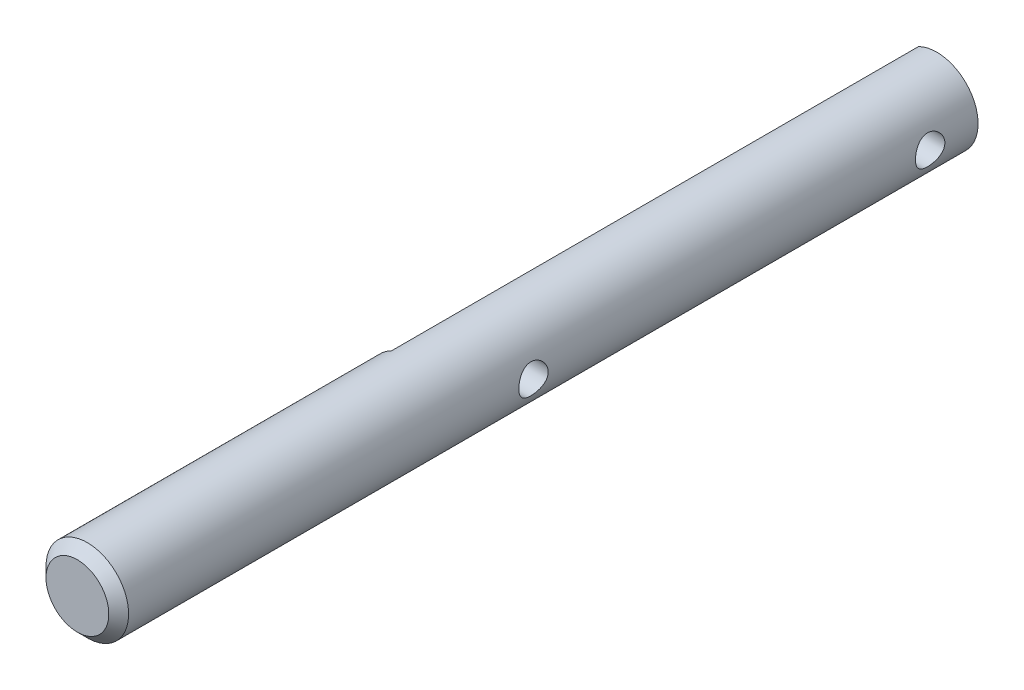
ISO-10303-21;
HEADER;
FILE_DESCRIPTION(('STEP AP214'),'2;1');
FILE_NAME('part.step','',(''),(''),'','','');
FILE_SCHEMA(('AUTOMOTIVE_DESIGN { 1 0 10303 214 1 1 1 1 }'));
ENDSEC;
DATA;
#1=APPLICATION_CONTEXT('core data for automotive mechanical design processes');
#2=APPLICATION_PROTOCOL_DEFINITION('international standard','automotive_design',2000,#1);
#3=PRODUCT_CONTEXT('',#1,'mechanical');
#4=PRODUCT('Part','Part','',(#3));
#5=PRODUCT_RELATED_PRODUCT_CATEGORY('part','',(#4));
#6=PRODUCT_DEFINITION_FORMATION('','',#4);
#7=PRODUCT_DEFINITION_CONTEXT('part definition',#1,'design');
#8=PRODUCT_DEFINITION('design','',#6,#7);
#9=PRODUCT_DEFINITION_SHAPE('','',#8);
#10=(LENGTH_UNIT() NAMED_UNIT(*) SI_UNIT(.MILLI.,.METRE.));
#11=(NAMED_UNIT(*) PLANE_ANGLE_UNIT() SI_UNIT($,.RADIAN.));
#12=(NAMED_UNIT(*) SI_UNIT($,.STERADIAN.) SOLID_ANGLE_UNIT());
#13=UNCERTAINTY_MEASURE_WITH_UNIT(LENGTH_MEASURE(1.E-05),#10,'distance_accuracy_value','');
#14=(GEOMETRIC_REPRESENTATION_CONTEXT(3) GLOBAL_UNCERTAINTY_ASSIGNED_CONTEXT((#13)) GLOBAL_UNIT_ASSIGNED_CONTEXT((#10,
#11,#12)) REPRESENTATION_CONTEXT('',''));
#15=CARTESIAN_POINT('',(0.,0.,0.));
#16=DIRECTION('',(0.,0.,1.));
#17=DIRECTION('',(1.,0.,0.));
#18=AXIS2_PLACEMENT_3D('',#15,#16,#17);
#19=CARTESIAN_POINT('',(0.,0.,160.02));
#20=DIRECTION('',(0.,0.,-1.));
#21=DIRECTION('',(-1.,0.,0.));
#22=AXIS2_PLACEMENT_3D('',#19,#20,#21);
#23=CYLINDRICAL_SURFACE('',#22,3.175);
#24=CARTESIAN_POINT('',(3.175,0.,127.0127));
#25=CARTESIAN_POINT('',(3.17500087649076,-0.0614285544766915,127.012698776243));
#26=CARTESIAN_POINT('',(3.17320130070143,-0.1228483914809,127.017723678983));
#27=CARTESIAN_POINT('',(3.1662010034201,-0.243864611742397,127.037618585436));
#28=CARTESIAN_POINT('',(3.16100038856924,-0.3034610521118,127.05248828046));
#29=CARTESIAN_POINT('',(3.14775949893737,-0.419068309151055,127.091488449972));
#30=CARTESIAN_POINT('',(3.13972436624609,-0.475085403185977,127.115602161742));
#31=CARTESIAN_POINT('',(3.12162393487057,-0.582278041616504,127.172325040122));
#32=CARTESIAN_POINT('',(3.11155815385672,-0.633452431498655,127.204936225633));
#33=CARTESIAN_POINT('',(3.09000790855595,-0.731495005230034,127.279055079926));
#34=CARTESIAN_POINT('',(3.07848610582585,-0.778149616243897,127.320834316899));
#35=CARTESIAN_POINT('',(3.055516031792,-0.863958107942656,127.411526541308));
#36=CARTESIAN_POINT('',(3.04406778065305,-0.903110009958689,127.460441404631));
#37=CARTESIAN_POINT('',(3.02211785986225,-0.974093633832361,127.566025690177));
#38=CARTESIAN_POINT('',(3.01166094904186,-1.00563502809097,127.622900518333));
#39=CARTESIAN_POINT('',(2.99345244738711,-1.0586113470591,127.7415793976));
#40=CARTESIAN_POINT('',(2.98569989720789,-1.08004985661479,127.803381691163));
#41=CARTESIAN_POINT('',(2.9741742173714,-1.11138819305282,127.927714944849));
#42=CARTESIAN_POINT('',(2.97026214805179,-1.12169236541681,127.990130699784));
#43=CARTESIAN_POINT('',(2.96645158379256,-1.13173392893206,128.115918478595));
#44=CARTESIAN_POINT('',(2.96655163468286,-1.13147514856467,128.179290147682));
#45=CARTESIAN_POINT('',(2.97063328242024,-1.12070953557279,128.301613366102));
#46=CARTESIAN_POINT('',(2.97440855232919,-1.11074743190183,128.360620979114));
#47=CARTESIAN_POINT('',(2.98507483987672,-1.08175290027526,128.476064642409));
#48=CARTESIAN_POINT('',(2.99196628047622,-1.06271924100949,128.53250034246));
#49=CARTESIAN_POINT('',(3.00822311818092,-1.01579639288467,128.642367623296));
#50=CARTESIAN_POINT('',(3.01763009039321,-0.9877566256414,128.695728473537));
#51=CARTESIAN_POINT('',(3.03784253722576,-0.923722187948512,128.797152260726));
#52=CARTESIAN_POINT('',(3.04864845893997,-0.887724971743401,128.845213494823));
#53=CARTESIAN_POINT('',(3.07123422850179,-0.806247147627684,128.937711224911));
#54=CARTESIAN_POINT('',(3.08303358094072,-0.760326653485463,128.981756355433));
#55=CARTESIAN_POINT('',(3.1057139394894,-0.661610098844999,129.061630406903));
#56=CARTESIAN_POINT('',(3.11659483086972,-0.608813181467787,129.097458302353));
#57=CARTESIAN_POINT('',(3.13639217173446,-0.496923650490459,129.160256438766));
#58=CARTESIAN_POINT('',(3.14528190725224,-0.437759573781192,129.187108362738));
#59=CARTESIAN_POINT('',(3.15989936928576,-0.315359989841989,129.23035200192));
#60=CARTESIAN_POINT('',(3.16562835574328,-0.252126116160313,129.246747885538));
#61=CARTESIAN_POINT('',(3.17306329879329,-0.126684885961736,129.26788948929));
#62=CARTESIAN_POINT('',(3.17495136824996,-0.0645771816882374,129.273163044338));
#63=CARTESIAN_POINT('',(3.17504672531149,0.059656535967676,129.273431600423));
#64=CARTESIAN_POINT('',(3.1732547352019,0.121782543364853,129.268428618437));
#65=CARTESIAN_POINT('',(3.16631168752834,0.242087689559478,129.248695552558));
#66=CARTESIAN_POINT('',(3.16127656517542,0.300329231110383,129.234300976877));
#67=CARTESIAN_POINT('',(3.14846933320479,0.413538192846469,129.19662458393));
#68=CARTESIAN_POINT('',(3.14069686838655,0.468505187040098,129.173341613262));
#69=CARTESIAN_POINT('',(3.12292068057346,0.575332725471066,129.117831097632));
#70=CARTESIAN_POINT('',(3.11286035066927,0.627062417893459,129.085370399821));
#71=CARTESIAN_POINT('',(3.09163517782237,0.724505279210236,129.012693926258));
#72=CARTESIAN_POINT('',(3.08046995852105,0.770216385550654,128.972475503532));
#73=CARTESIAN_POINT('',(3.05754963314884,0.856811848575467,128.882951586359));
#74=CARTESIAN_POINT('',(3.04579412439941,0.897320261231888,128.833281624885));
#75=CARTESIAN_POINT('',(3.02359841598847,0.969488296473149,128.727605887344));
#76=CARTESIAN_POINT('',(3.01315827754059,1.00114750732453,128.671599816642));
#77=CARTESIAN_POINT('',(2.99485112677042,1.05465477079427,128.554607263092));
#78=CARTESIAN_POINT('',(2.98698641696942,1.07649405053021,128.493616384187));
#79=CARTESIAN_POINT('',(2.97489781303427,1.10946944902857,128.36847036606));
#80=CARTESIAN_POINT('',(2.97067196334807,1.12061131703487,128.304316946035));
#81=CARTESIAN_POINT('',(2.96658222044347,1.13139068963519,128.178694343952));
#82=CARTESIAN_POINT('',(2.9664783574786,1.13166111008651,128.117286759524));
#83=CARTESIAN_POINT('',(2.97003931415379,1.1222816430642,127.995351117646));
#84=CARTESIAN_POINT('',(2.97370384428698,1.11263251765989,127.934822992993));
#85=CARTESIAN_POINT('',(2.98419839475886,1.08416089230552,127.817872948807));
#86=CARTESIAN_POINT('',(2.9909477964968,1.06557142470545,127.761386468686));
#87=CARTESIAN_POINT('',(3.00681233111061,1.01994372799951,127.652295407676));
#88=CARTESIAN_POINT('',(3.01592803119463,0.992903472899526,127.599691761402));
#89=CARTESIAN_POINT('',(3.03604854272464,0.929616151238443,127.497090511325));
#90=CARTESIAN_POINT('',(3.04712352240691,0.892986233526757,127.447342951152));
#91=CARTESIAN_POINT('',(3.06964995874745,0.812177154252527,127.354497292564));
#92=CARTESIAN_POINT('',(3.08110152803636,0.767995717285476,127.311401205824));
#93=CARTESIAN_POINT('',(3.10373428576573,0.670861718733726,127.231036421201));
#94=CARTESIAN_POINT('',(3.11487776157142,0.617595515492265,127.194134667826));
#95=CARTESIAN_POINT('',(3.13506244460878,0.505234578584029,127.129834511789));
#96=CARTESIAN_POINT('',(3.1441038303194,0.446140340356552,127.102435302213));
#97=CARTESIAN_POINT('',(3.15906443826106,0.323645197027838,127.058066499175));
#98=CARTESIAN_POINT('',(3.16497811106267,0.260236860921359,127.041115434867));
#99=CARTESIAN_POINT('',(3.17294468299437,0.131215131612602,127.018434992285));
#100=CARTESIAN_POINT('',(3.17499906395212,0.0656025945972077,127.012701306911));
#101=CARTESIAN_POINT('',(3.175,0.,127.0127));
#102=B_SPLINE_CURVE_WITH_KNOTS('',3,(#24,#25,#26,#27,#28,#29,#30,#31,#32,#33,#34,#35,#36,#37,
#38,#39,#40,#41,#42,#43,#44,#45,#46,#47,#48,#49,#50,#51,#52,#53,#54,#55,#56,#57,#58,#59,#60,#61,
#62,#63,#64,#65,#66,#67,#68,#69,#70,#71,#72,#73,#74,#75,#76,#77,#78,#79,#80,#81,#82,#83,#84,#85,
#86,#87,#88,#89,#90,#91,#92,#93,#94,#95,#96,#97,#98,#99,#100,#101),.UNSPECIFIED.,.T.,.F.,(4,2,2,
2,2,2,2,2,2,2,2,2,2,2,2,2,2,2,2,2,2,2,2,2,2,2,2,2,2,2,2,2,2,2,2,2,2,2,4),(0.,0.184043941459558,
0.368082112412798,0.551788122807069,0.735537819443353,0.925722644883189,1.11595755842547,
1.31258758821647,1.50914779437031,1.6983014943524,1.88738663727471,2.06643452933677,
2.24550673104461,2.42774410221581,2.61003985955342,2.80329006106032,2.99656436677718,
3.19229416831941,3.38794589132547,3.57408187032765,3.76018131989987,3.93997181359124,
4.11978564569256,4.30465683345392,4.48959121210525,4.6841682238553,4.87875428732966,
5.07351384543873,5.2681686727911,5.45147357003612,5.634764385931,5.81351722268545,
5.9923129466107,6.17977826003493,6.36730015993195,6.56359488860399,6.75987294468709,
6.95649809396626,7.15304773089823),.UNSPECIFIED.);
#103=CARTESIAN_POINT('',(3.175,0.,127.0127));
#104=VERTEX_POINT('',#103);
#105=EDGE_CURVE('E84',#104,#104,#102,.T.);
#106=ORIENTED_EDGE('',*,*,#105,.T.);
#107=EDGE_LOOP('',(#106));
#108=FACE_BOUND('',#107,.T.);
#109=CARTESIAN_POINT('',(3.175,0.,96.5327));
#110=CARTESIAN_POINT('',(3.17500087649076,-0.0614285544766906,96.5326987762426));
#111=CARTESIAN_POINT('',(3.17320130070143,-0.122848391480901,96.5377236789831));
#112=CARTESIAN_POINT('',(3.1662010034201,-0.243864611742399,96.5576185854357));
#113=CARTESIAN_POINT('',(3.16100038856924,-0.303461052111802,96.57248828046));
#114=CARTESIAN_POINT('',(3.14775949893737,-0.419068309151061,96.6114884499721));
#115=CARTESIAN_POINT('',(3.13972436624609,-0.475085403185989,96.6356021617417));
#116=CARTESIAN_POINT('',(3.12162393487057,-0.58227804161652,96.6923250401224));
#117=CARTESIAN_POINT('',(3.11155815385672,-0.633452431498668,96.7249362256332));
#118=CARTESIAN_POINT('',(3.09000790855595,-0.731495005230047,96.7990550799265));
#119=CARTESIAN_POINT('',(3.07848610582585,-0.778149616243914,96.8408343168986));
#120=CARTESIAN_POINT('',(3.05551603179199,-0.863958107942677,96.9315265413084));
#121=CARTESIAN_POINT('',(3.04406778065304,-0.903110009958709,96.9804414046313));
#122=CARTESIAN_POINT('',(3.02211785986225,-0.974093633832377,97.086025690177));
#123=CARTESIAN_POINT('',(3.01166094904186,-1.00563502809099,97.1429005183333));
#124=CARTESIAN_POINT('',(2.9934524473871,-1.05861134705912,97.2615793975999));
#125=CARTESIAN_POINT('',(2.98569989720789,-1.08004985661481,97.3233816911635));
#126=CARTESIAN_POINT('',(2.97417421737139,-1.11138819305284,97.4477149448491));
#127=CARTESIAN_POINT('',(2.97026214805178,-1.12169236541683,97.5101306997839));
#128=CARTESIAN_POINT('',(2.96645158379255,-1.13173392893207,97.6359184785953));
#129=CARTESIAN_POINT('',(2.96655163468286,-1.13147514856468,97.6992901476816));
#130=CARTESIAN_POINT('',(2.97063328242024,-1.1207095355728,97.8216133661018));
#131=CARTESIAN_POINT('',(2.97440855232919,-1.11074743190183,97.8806209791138));
#132=CARTESIAN_POINT('',(2.98507483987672,-1.08175290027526,97.9960646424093));
#133=CARTESIAN_POINT('',(2.99196628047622,-1.06271924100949,98.0525003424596));
#134=CARTESIAN_POINT('',(3.00822311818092,-1.01579639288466,98.162367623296));
#135=CARTESIAN_POINT('',(3.01763009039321,-0.987756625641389,98.2157284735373));
#136=CARTESIAN_POINT('',(3.03784253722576,-0.9237221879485,98.317152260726));
#137=CARTESIAN_POINT('',(3.04864845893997,-0.887724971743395,98.3652134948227));
#138=CARTESIAN_POINT('',(3.07123422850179,-0.806247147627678,98.4577112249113));
#139=CARTESIAN_POINT('',(3.08303358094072,-0.760326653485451,98.5017563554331));
#140=CARTESIAN_POINT('',(3.10571393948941,-0.661610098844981,98.581630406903));
#141=CARTESIAN_POINT('',(3.11659483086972,-0.608813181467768,98.617458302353));
#142=CARTESIAN_POINT('',(3.13639217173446,-0.49692365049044,98.6802564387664));
#143=CARTESIAN_POINT('',(3.14528190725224,-0.437759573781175,98.7071083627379));
#144=CARTESIAN_POINT('',(3.15989936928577,-0.315359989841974,98.7503520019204));
#145=CARTESIAN_POINT('',(3.16562835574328,-0.252126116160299,98.7667478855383));
#146=CARTESIAN_POINT('',(3.17306329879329,-0.126684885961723,98.7878894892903));
#147=CARTESIAN_POINT('',(3.17495136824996,-0.0645771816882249,98.7931630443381));
#148=CARTESIAN_POINT('',(3.17504672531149,0.0596565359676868,98.7934316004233));
#149=CARTESIAN_POINT('',(3.1732547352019,0.121782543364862,98.7884286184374));
#150=CARTESIAN_POINT('',(3.16631168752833,0.242087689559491,98.7686955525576));
#151=CARTESIAN_POINT('',(3.16127656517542,0.300329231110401,98.7543009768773));
#152=CARTESIAN_POINT('',(3.14846933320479,0.41353819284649,98.71662458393));
#153=CARTESIAN_POINT('',(3.14069686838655,0.468505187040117,98.6933416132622));
#154=CARTESIAN_POINT('',(3.12292068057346,0.57533272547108,98.6378310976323));
#155=CARTESIAN_POINT('',(3.11286035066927,0.627062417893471,98.605370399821));
#156=CARTESIAN_POINT('',(3.09163517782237,0.724505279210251,98.5326939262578));
#157=CARTESIAN_POINT('',(3.08046995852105,0.770216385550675,98.4924755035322));
#158=CARTESIAN_POINT('',(3.05754963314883,0.85681184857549,98.402951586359));
#159=CARTESIAN_POINT('',(3.0457941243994,0.897320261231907,98.3532816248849));
#160=CARTESIAN_POINT('',(3.02359841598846,0.969488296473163,98.2476058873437));
#161=CARTESIAN_POINT('',(3.01315827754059,1.00114750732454,98.191599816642));
#162=CARTESIAN_POINT('',(2.99485112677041,1.05465477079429,98.0746072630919));
#163=CARTESIAN_POINT('',(2.98698641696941,1.07649405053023,98.0136163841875));
#164=CARTESIAN_POINT('',(2.97489781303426,1.10946944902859,97.8884703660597));
#165=CARTESIAN_POINT('',(2.97067196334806,1.12061131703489,97.8243169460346));
#166=CARTESIAN_POINT('',(2.96658222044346,1.1313906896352,97.6986943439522));
#167=CARTESIAN_POINT('',(2.9664783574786,1.13166111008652,97.6372867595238));
#168=CARTESIAN_POINT('',(2.97003931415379,1.12228164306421,97.5153511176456));
#169=CARTESIAN_POINT('',(2.97370384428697,1.1126325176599,97.4548229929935));
#170=CARTESIAN_POINT('',(2.98419839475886,1.08416089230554,97.3378729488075));
#171=CARTESIAN_POINT('',(2.9909477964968,1.06557142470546,97.2813864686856));
#172=CARTESIAN_POINT('',(3.0068123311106,1.01994372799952,97.172295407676));
#173=CARTESIAN_POINT('',(3.01592803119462,0.992903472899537,97.1196917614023));
#174=CARTESIAN_POINT('',(3.03604854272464,0.929616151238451,97.0170905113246));
#175=CARTESIAN_POINT('',(3.0471235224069,0.892986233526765,96.9673429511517));
#176=CARTESIAN_POINT('',(3.06964995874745,0.812177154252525,96.8744972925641));
#177=CARTESIAN_POINT('',(3.08110152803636,0.767995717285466,96.8314012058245));
#178=CARTESIAN_POINT('',(3.10373428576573,0.670861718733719,96.7510364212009));
#179=CARTESIAN_POINT('',(3.11487776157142,0.617595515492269,96.714134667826));
#180=CARTESIAN_POINT('',(3.13506244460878,0.505234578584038,96.6498345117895));
#181=CARTESIAN_POINT('',(3.1441038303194,0.446140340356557,96.6224353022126));
#182=CARTESIAN_POINT('',(3.15906443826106,0.323645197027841,96.5780664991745));
#183=CARTESIAN_POINT('',(3.16497811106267,0.260236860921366,96.5611154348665));
#184=CARTESIAN_POINT('',(3.17294468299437,0.13121513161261,96.5384349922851));
#185=CARTESIAN_POINT('',(3.17499906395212,0.0656025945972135,96.5327013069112));
#186=CARTESIAN_POINT('',(3.175,0.,96.5327));
#187=B_SPLINE_CURVE_WITH_KNOTS('',3,(#109,#110,#111,#112,#113,#114,#115,#116,#117,#118,#119,
#120,#121,#122,#123,#124,#125,#126,#127,#128,#129,#130,#131,#132,#133,#134,#135,#136,#137,#138,
#139,#140,#141,#142,#143,#144,#145,#146,#147,#148,#149,#150,#151,#152,#153,#154,#155,#156,#157,
#158,#159,#160,#161,#162,#163,#164,#165,#166,#167,#168,#169,#170,#171,#172,#173,#174,#175,#176,
#177,#178,#179,#180,#181,#182,#183,#184,#185,#186),.UNSPECIFIED.,.T.,.F.,(4,2,2,2,2,2,2,2,2,2,2,
2,2,2,2,2,2,2,2,2,2,2,2,2,2,2,2,2,2,2,2,2,2,2,2,2,2,2,4),(0.,0.184043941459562,
0.368082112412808,0.551788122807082,0.735537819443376,0.925722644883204,1.1159575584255,
1.31258758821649,1.50914779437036,1.69830149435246,1.88738663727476,2.06643452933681,
2.24550673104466,2.42774410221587,2.61003985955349,2.80329006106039,2.99656436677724,
3.19229416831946,3.38794589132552,3.5740818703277,3.76018131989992,3.9399718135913,
4.11978564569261,4.30465683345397,4.48959121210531,4.68416822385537,4.87875428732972,
5.07351384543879,5.26816867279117,5.45147357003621,5.63476438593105,5.81351722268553,
5.99231294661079,6.17977826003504,6.36730015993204,6.56359488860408,6.75987294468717,
6.95649809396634,7.15304773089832),.UNSPECIFIED.);
#188=CARTESIAN_POINT('',(3.175,0.,96.5327));
#189=VERTEX_POINT('',#188);
#190=EDGE_CURVE('E78',#189,#189,#187,.T.);
#191=ORIENTED_EDGE('',*,*,#190,.T.);
#192=EDGE_LOOP('',(#191));
#193=FACE_BOUND('',#192,.T.);
#194=CARTESIAN_POINT('',(0.,0.,159.258));
#195=DIRECTION('',(0.,0.,1.));
#196=DIRECTION('',(1.,0.,0.));
#197=AXIS2_PLACEMENT_3D('',#194,#195,#196);
#198=CIRCLE('',#197,3.175);
#199=CARTESIAN_POINT('',(-3.17500000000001,0.,159.258));
#200=VERTEX_POINT('',#199);
#201=EDGE_CURVE('E67',#200,#200,#198,.F.);
#202=ORIENTED_EDGE('',*,*,#201,.T.);
#203=EDGE_LOOP('',(#202));
#204=FACE_BOUND('',#203,.T.);
#205=CARTESIAN_POINT('',(0.,0.,93.98));
#206=DIRECTION('',(0.,0.,-1.));
#207=DIRECTION('',(-1.,0.,0.));
#208=AXIS2_PLACEMENT_3D('',#205,#206,#207);
#209=CIRCLE('',#208,3.175);
#210=CARTESIAN_POINT('',(-1.397,2.85114292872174,93.98));
#211=VERTEX_POINT('',#210);
#212=CARTESIAN_POINT('',(-1.397,-2.85114292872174,93.98));
#213=VERTEX_POINT('',#212);
#214=EDGE_CURVE('E46',#211,#213,#209,.T.);
#215=ORIENTED_EDGE('',*,*,#214,.F.);
#216=DIRECTION('',(0.,0.,-1.));
#217=VECTOR('',#216,1.);
#218=CARTESIAN_POINT('',(-1.397,2.85114292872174,160.02));
#219=LINE('',#218,#217);
#220=CARTESIAN_POINT('',(-1.397,2.85114292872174,134.493));
#221=VERTEX_POINT('',#220);
#222=EDGE_CURVE('E63',#221,#211,#219,.T.);
#223=ORIENTED_EDGE('',*,*,#222,.F.);
#224=CARTESIAN_POINT('',(0.,0.,134.493));
#225=DIRECTION('',(0.,0.,-1.));
#226=DIRECTION('',(-1.,0.,0.));
#227=AXIS2_PLACEMENT_3D('',#224,#225,#226);
#228=CIRCLE('',#227,3.175);
#229=CARTESIAN_POINT('',(-1.397,-2.85114292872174,134.493));
#230=VERTEX_POINT('',#229);
#231=EDGE_CURVE('E40',#230,#221,#228,.T.);
#232=ORIENTED_EDGE('',*,*,#231,.F.);
#233=DIRECTION('',(0.,0.,-1.));
#234=VECTOR('',#233,1.);
#235=CARTESIAN_POINT('',(-1.397,-2.85114292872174,160.02));
#236=LINE('',#235,#234);
#237=EDGE_CURVE('E52',#213,#230,#236,.F.);
#238=ORIENTED_EDGE('',*,*,#237,.F.);
#239=EDGE_LOOP('',(#215,#223,#232,#238));
#240=FACE_BOUND('',#239,.T.);
#241=ADVANCED_FACE('F32',(#108,#193,#204,#240),#23,.T.);
#242=CARTESIAN_POINT('',(-1.397,-3.175,7.493));
#243=DIRECTION('',(-1.,0.,0.));
#244=DIRECTION('',(0.,0.,1.));
#245=AXIS2_PLACEMENT_3D('',#242,#243,#244);
#246=PLANE('',#245);
#247=CARTESIAN_POINT('',(-1.397,0.,128.143));
#248=DIRECTION('',(-1.,0.,0.));
#249=DIRECTION('',(0.,0.,1.));
#250=AXIS2_PLACEMENT_3D('',#247,#248,#249);
#251=CIRCLE('',#250,1.13029999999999);
#252=CARTESIAN_POINT('',(-1.397,0.,129.2733));
#253=VERTEX_POINT('',#252);
#254=EDGE_CURVE('E128',#253,#253,#251,.F.);
#255=ORIENTED_EDGE('',*,*,#254,.T.);
#256=EDGE_LOOP('',(#255));
#257=FACE_BOUND('',#256,.T.);
#258=CARTESIAN_POINT('',(-1.397,0.,97.663));
#259=DIRECTION('',(-1.,0.,0.));
#260=DIRECTION('',(0.,0.,1.));
#261=AXIS2_PLACEMENT_3D('',#258,#259,#260);
#262=CIRCLE('',#261,1.1303);
#263=CARTESIAN_POINT('',(-1.397,0.,98.7933));
#264=VERTEX_POINT('',#263);
#265=EDGE_CURVE('E72',#264,#264,#262,.F.);
#266=ORIENTED_EDGE('',*,*,#265,.T.);
#267=EDGE_LOOP('',(#266));
#268=FACE_BOUND('',#267,.T.);
#269=ORIENTED_EDGE('',*,*,#222,.T.);
#270=DIRECTION('',(0.,-1.,0.));
#271=VECTOR('',#270,1.);
#272=CARTESIAN_POINT('',(-1.397,-3.175,93.98));
#273=LINE('',#272,#271);
#274=EDGE_CURVE('E11',#211,#213,#273,.T.);
#275=ORIENTED_EDGE('',*,*,#274,.T.);
#276=ORIENTED_EDGE('',*,*,#237,.T.);
#277=DIRECTION('',(0.,-1.,0.));
#278=VECTOR('',#277,1.);
#279=CARTESIAN_POINT('',(-1.397,3.175,134.493));
#280=LINE('',#279,#278);
#281=EDGE_CURVE('E64',#221,#230,#280,.T.);
#282=ORIENTED_EDGE('',*,*,#281,.F.);
#283=EDGE_LOOP('',(#269,#275,#276,#282));
#284=FACE_BOUND('',#283,.T.);
#285=ADVANCED_FACE('F66',(#257,#268,#284),#246,.T.);
#286=CARTESIAN_POINT('',(-3.175,0.,97.663));
#287=DIRECTION('',(1.,0.,0.));
#288=DIRECTION('',(0.,0.,-1.));
#289=AXIS2_PLACEMENT_3D('',#286,#287,#288);
#290=CYLINDRICAL_SURFACE('',#289,1.1303);
#291=ORIENTED_EDGE('',*,*,#190,.F.);
#292=EDGE_LOOP('',(#291));
#293=FACE_BOUND('',#292,.T.);
#294=ORIENTED_EDGE('',*,*,#265,.F.);
#295=EDGE_LOOP('',(#294));
#296=FACE_BOUND('',#295,.T.);
#297=ADVANCED_FACE('F91',(#293,#296),#290,.F.);
#298=CARTESIAN_POINT('',(-3.175,0.,128.143));
#299=DIRECTION('',(1.,0.,0.));
#300=DIRECTION('',(0.,0.,-1.));
#301=AXIS2_PLACEMENT_3D('',#298,#299,#300);
#302=CYLINDRICAL_SURFACE('',#301,1.13029999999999);
#303=ORIENTED_EDGE('',*,*,#105,.F.);
#304=EDGE_LOOP('',(#303));
#305=FACE_BOUND('',#304,.T.);
#306=ORIENTED_EDGE('',*,*,#254,.F.);
#307=EDGE_LOOP('',(#306));
#308=FACE_BOUND('',#307,.T.);
#309=ADVANCED_FACE('F94',(#305,#308),#302,.F.);
#310=CARTESIAN_POINT('',(0.,0.,160.02));
#311=DIRECTION('',(0.,0.,1.));
#312=DIRECTION('',(1.,0.,0.));
#313=AXIS2_PLACEMENT_3D('',#310,#311,#312);
#314=PLANE('',#313);
#315=CARTESIAN_POINT('',(0.,0.,160.02));
#316=DIRECTION('',(0.,0.,1.));
#317=DIRECTION('',(1.,0.,0.));
#318=AXIS2_PLACEMENT_3D('',#315,#316,#317);
#319=CIRCLE('',#318,2.41299999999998);
#320=CARTESIAN_POINT('',(-2.413,0.,160.02));
#321=VERTEX_POINT('',#320);
#322=EDGE_CURVE('E70',#321,#321,#319,.T.);
#323=ORIENTED_EDGE('',*,*,#322,.T.);
#324=EDGE_LOOP('',(#323));
#325=FACE_BOUND('',#324,.T.);
#326=ADVANCED_FACE('F98',(#325),#314,.T.);
#327=CARTESIAN_POINT('',(0.,0.,160.02));
#328=DIRECTION('',(0.,0.,-1.));
#329=DIRECTION('',(-1.,0.,0.));
#330=AXIS2_PLACEMENT_3D('',#327,#328,#329);
#331=CONICAL_SURFACE('',#330,2.41299999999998,0.78539816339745);
#332=CARTESIAN_POINT('',(-3.17500000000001,0.,159.258));
#333=CARTESIAN_POINT('',(-3.16706250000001,0.,159.2659375));
#334=CARTESIAN_POINT('',(-3.15912500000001,0.,159.273875));
#335=CARTESIAN_POINT('',(-3.14325000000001,0.,159.28975));
#336=CARTESIAN_POINT('',(-3.13531250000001,0.,159.2976875));
#337=CARTESIAN_POINT('',(-3.11943750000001,0.,159.3135625));
#338=CARTESIAN_POINT('',(-3.11150000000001,0.,159.3215));
#339=CARTESIAN_POINT('',(-3.09562500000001,0.,159.337375));
#340=CARTESIAN_POINT('',(-3.08768750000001,0.,159.3453125));
#341=CARTESIAN_POINT('',(-3.07181250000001,0.,159.3611875));
#342=CARTESIAN_POINT('',(-3.06387500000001,0.,159.369125));
#343=CARTESIAN_POINT('',(-3.04800000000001,0.,159.385));
#344=CARTESIAN_POINT('',(-3.04006250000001,0.,159.3929375));
#345=CARTESIAN_POINT('',(-3.02418750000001,0.,159.4088125));
#346=CARTESIAN_POINT('',(-3.01625000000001,0.,159.41675));
#347=CARTESIAN_POINT('',(-3.00037500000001,0.,159.432625));
#348=CARTESIAN_POINT('',(-2.99243750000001,0.,159.4405625));
#349=CARTESIAN_POINT('',(-2.97656250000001,0.,159.4564375));
#350=CARTESIAN_POINT('',(-2.96862500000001,0.,159.464375));
#351=CARTESIAN_POINT('',(-2.95275000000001,0.,159.48025));
#352=CARTESIAN_POINT('',(-2.94481250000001,0.,159.4881875));
#353=CARTESIAN_POINT('',(-2.92893750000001,0.,159.5040625));
#354=CARTESIAN_POINT('',(-2.92100000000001,0.,159.512));
#355=CARTESIAN_POINT('',(-2.90512500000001,0.,159.527875));
#356=CARTESIAN_POINT('',(-2.89718750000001,0.,159.5358125));
#357=CARTESIAN_POINT('',(-2.88131250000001,0.,159.5516875));
#358=CARTESIAN_POINT('',(-2.87337500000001,0.,159.559625));
#359=CARTESIAN_POINT('',(-2.85750000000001,0.,159.5755));
#360=CARTESIAN_POINT('',(-2.84956250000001,0.,159.5834375));
#361=CARTESIAN_POINT('',(-2.83368750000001,0.,159.5993125));
#362=CARTESIAN_POINT('',(-2.82575000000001,0.,159.60725));
#363=CARTESIAN_POINT('',(-2.80987500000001,0.,159.623125));
#364=CARTESIAN_POINT('',(-2.80193750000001,0.,159.6310625));
#365=CARTESIAN_POINT('',(-2.78606250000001,0.,159.6469375));
#366=CARTESIAN_POINT('',(-2.77812500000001,0.,159.654875));
#367=CARTESIAN_POINT('',(-2.76225000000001,0.,159.67075));
#368=CARTESIAN_POINT('',(-2.75431250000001,0.,159.6786875));
#369=CARTESIAN_POINT('',(-2.73843750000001,0.,159.6945625));
#370=CARTESIAN_POINT('',(-2.7305,0.,159.7025));
#371=CARTESIAN_POINT('',(-2.714625,0.,159.718375));
#372=CARTESIAN_POINT('',(-2.70668750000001,0.,159.7263125));
#373=CARTESIAN_POINT('',(-2.6908125,0.,159.7421875));
#374=CARTESIAN_POINT('',(-2.682875,0.,159.750125));
#375=CARTESIAN_POINT('',(-2.667,0.,159.766));
#376=CARTESIAN_POINT('',(-2.6590625,0.,159.7739375));
#377=CARTESIAN_POINT('',(-2.64318750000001,0.,159.7898125));
#378=CARTESIAN_POINT('',(-2.63525,0.,159.79775));
#379=CARTESIAN_POINT('',(-2.619375,0.,159.813625));
#380=CARTESIAN_POINT('',(-2.6114375,0.,159.8215625));
#381=CARTESIAN_POINT('',(-2.5955625,0.,159.8374375));
#382=CARTESIAN_POINT('',(-2.587625,0.,159.845375));
#383=CARTESIAN_POINT('',(-2.57175,0.,159.86125));
#384=CARTESIAN_POINT('',(-2.5638125,0.,159.8691875));
#385=CARTESIAN_POINT('',(-2.5479375,0.,159.8850625));
#386=CARTESIAN_POINT('',(-2.54,0.,159.893));
#387=CARTESIAN_POINT('',(-2.524125,0.,159.908875));
#388=CARTESIAN_POINT('',(-2.5161875,0.,159.9168125));
#389=CARTESIAN_POINT('',(-2.5003125,0.,159.9326875));
#390=CARTESIAN_POINT('',(-2.492375,0.,159.940625));
#391=CARTESIAN_POINT('',(-2.4765,0.,159.9565));
#392=CARTESIAN_POINT('',(-2.4685625,0.,159.9644375));
#393=CARTESIAN_POINT('',(-2.4526875,0.,159.9803125));
#394=CARTESIAN_POINT('',(-2.44475,0.,159.98825));
#395=CARTESIAN_POINT('',(-2.428875,0.,160.004125));
#396=CARTESIAN_POINT('',(-2.42093749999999,0.,160.0120625));
#397=CARTESIAN_POINT('',(-2.413,0.,160.02));
#398=B_SPLINE_CURVE_WITH_KNOTS('',3,(#332,#333,#334,#335,#336,#337,#338,#339,#340,#341,#342,
#343,#344,#345,#346,#347,#348,#349,#350,#351,#352,#353,#354,#355,#356,#357,#358,#359,#360,#361,
#362,#363,#364,#365,#366,#367,#368,#369,#370,#371,#372,#373,#374,#375,#376,#377,#378,#379,#380,
#381,#382,#383,#384,#385,#386,#387,#388,#389,#390,#391,#392,#393,#394,#395,#396,#397),
.UNSPECIFIED.,.F.,.F.,(4,2,2,2,2,2,2,2,2,2,2,2,2,2,2,2,2,2,2,2,2,2,2,2,2,2,2,2,2,2,2,2,4),(0.,
0.033675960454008,0.0673519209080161,0.101027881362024,0.134703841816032,0.168379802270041,
0.202055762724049,0.235731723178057,0.269407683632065,0.303083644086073,0.336759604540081,
0.370435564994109,0.404111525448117,0.437787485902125,0.471463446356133,0.505139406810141,
0.538815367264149,0.572491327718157,0.606167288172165,0.639843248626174,0.673519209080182,
0.70719516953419,0.740871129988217,0.774547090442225,0.808223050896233,0.841899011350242,
0.87557497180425,0.909250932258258,0.942926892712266,0.976602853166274,1.01027881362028,
1.04395477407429,1.07763073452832),.UNSPECIFIED.);
#399=EDGE_CURVE('BSEAM34',#200,#321,#398,.T.);
#400=ORIENTED_EDGE('',*,*,#201,.F.);
#401=ORIENTED_EDGE('',*,*,#322,.F.);
#402=ORIENTED_EDGE('',*,*,#399,.T.);
#403=ORIENTED_EDGE('',*,*,#399,.F.);
#404=EDGE_LOOP('',(#400,#402,#401,#403));
#405=FACE_BOUND('',#404,.T.);
#406=ADVANCED_FACE('F34',(#405),#331,.T.);
#407=CARTESIAN_POINT('',(-1.397,3.175,134.493));
#408=DIRECTION('',(0.,0.,-1.));
#409=DIRECTION('',(-1.,0.,0.));
#410=AXIS2_PLACEMENT_3D('',#407,#408,#409);
#411=PLANE('',#410);
#412=ORIENTED_EDGE('',*,*,#231,.T.);
#413=ORIENTED_EDGE('',*,*,#281,.T.);
#414=EDGE_LOOP('',(#412,#413));
#415=FACE_BOUND('',#414,.T.);
#416=ADVANCED_FACE('F105',(#415),#411,.T.);
#417=CARTESIAN_POINT('',(0.,0.,93.98));
#418=DIRECTION('',(0.,0.,-1.));
#419=DIRECTION('',(-1.,0.,0.));
#420=AXIS2_PLACEMENT_3D('',#417,#418,#419);
#421=PLANE('',#420);
#422=ORIENTED_EDGE('',*,*,#214,.T.);
#423=ORIENTED_EDGE('',*,*,#274,.F.);
#424=EDGE_LOOP('',(#422,#423));
#425=FACE_BOUND('',#424,.T.);
#426=ADVANCED_FACE('F58',(#425),#421,.T.);
#427=CLOSED_SHELL('',(#241,#285,#297,#309,#326,#406,#416,#426));
#428=MANIFOLD_SOLID_BREP('B2',#427);
#429=ADVANCED_BREP_SHAPE_REPRESENTATION('',(#18,#428),#14);
#430=SHAPE_DEFINITION_REPRESENTATION(#9,#429);
ENDSEC;
END-ISO-10303-21;
